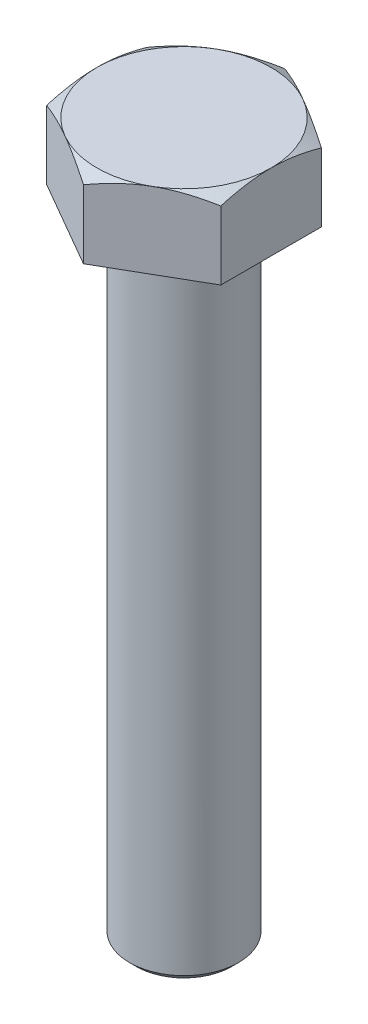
ISO-10303-21;
HEADER;
FILE_DESCRIPTION(('STEP AP214'),'2;1');
FILE_NAME('part.step','',(''),(''),'','','');
FILE_SCHEMA(('AUTOMOTIVE_DESIGN { 1 0 10303 214 1 1 1 1 }'));
ENDSEC;
DATA;
#1=APPLICATION_CONTEXT('core data for automotive mechanical design processes');
#2=APPLICATION_PROTOCOL_DEFINITION('international standard','automotive_design',2000,#1);
#3=PRODUCT_CONTEXT('',#1,'mechanical');
#4=PRODUCT('Part','Part','',(#3));
#5=PRODUCT_RELATED_PRODUCT_CATEGORY('part','',(#4));
#6=PRODUCT_DEFINITION_FORMATION('','',#4);
#7=PRODUCT_DEFINITION_CONTEXT('part definition',#1,'design');
#8=PRODUCT_DEFINITION('design','',#6,#7);
#9=PRODUCT_DEFINITION_SHAPE('','',#8);
#10=(LENGTH_UNIT() NAMED_UNIT(*) SI_UNIT(.MILLI.,.METRE.));
#11=(NAMED_UNIT(*) PLANE_ANGLE_UNIT() SI_UNIT($,.RADIAN.));
#12=(NAMED_UNIT(*) SI_UNIT($,.STERADIAN.) SOLID_ANGLE_UNIT());
#13=UNCERTAINTY_MEASURE_WITH_UNIT(LENGTH_MEASURE(1.E-05),#10,'distance_accuracy_value','');
#14=(GEOMETRIC_REPRESENTATION_CONTEXT(3) GLOBAL_UNCERTAINTY_ASSIGNED_CONTEXT((#13)) GLOBAL_UNIT_ASSIGNED_CONTEXT((#10,
#11,#12)) REPRESENTATION_CONTEXT('',''));
#15=CARTESIAN_POINT('',(0.,0.,0.));
#16=DIRECTION('',(0.,0.,1.));
#17=DIRECTION('',(1.,0.,0.));
#18=AXIS2_PLACEMENT_3D('',#15,#16,#17);
#19=CARTESIAN_POINT('',(0.,-70.,0.));
#20=DIRECTION('',(0.,1.,0.));
#21=DIRECTION('',(0.,0.,1.));
#22=AXIS2_PLACEMENT_3D('',#19,#20,#21);
#23=CYLINDRICAL_SURFACE('',#22,6.);
#24=CARTESIAN_POINT('',(0.,0.,0.));
#25=DIRECTION('',(0.,1.,0.));
#26=DIRECTION('',(0.,0.,1.));
#27=AXIS2_PLACEMENT_3D('',#24,#25,#26);
#28=CIRCLE('',#27,6.);
#29=CARTESIAN_POINT('',(0.,0.,6.));
#30=VERTEX_POINT('',#29);
#31=EDGE_CURVE('E276',#30,#30,#28,.F.);
#32=ORIENTED_EDGE('',*,*,#31,.T.);
#33=EDGE_LOOP('',(#32));
#34=FACE_BOUND('',#33,.T.);
#35=CARTESIAN_POINT('',(0.,-69.25,0.));
#36=DIRECTION('',(0.,1.,0.));
#37=DIRECTION('',(0.,0.,1.));
#38=AXIS2_PLACEMENT_3D('',#35,#36,#37);
#39=CIRCLE('',#38,6.);
#40=CARTESIAN_POINT('',(0.,-69.25,6.));
#41=VERTEX_POINT('',#40);
#42=EDGE_CURVE('E352',#41,#41,#39,.F.);
#43=ORIENTED_EDGE('',*,*,#42,.F.);
#44=EDGE_LOOP('',(#43));
#45=FACE_BOUND('',#44,.T.);
#46=ADVANCED_FACE('F62',(#34,#45),#23,.T.);
#47=CARTESIAN_POINT('',(9.59999999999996,8.4,-5.54256258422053));
#48=DIRECTION('',(-0.499999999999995,0.,0.866025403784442));
#49=DIRECTION('',(0.866025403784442,0.,0.499999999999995));
#50=AXIS2_PLACEMENT_3D('',#47,#48,#49);
#51=PLANE('',#50);
#52=CARTESIAN_POINT('',(9.60019999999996,7.5424959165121,-5.5424471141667));
#53=CARTESIAN_POINT('',(9.3891710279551,7.61282751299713,-5.66428474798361));
#54=CARTESIAN_POINT('',(9.1773552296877,7.67996698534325,-5.7865766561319));
#55=CARTESIAN_POINT('',(8.75202502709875,7.80697596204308,-6.03214116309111));
#56=CARTESIAN_POINT('',(8.53851008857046,7.86684307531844,-6.15541407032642));
#57=CARTESIAN_POINT('',(7.89452489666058,8.03437730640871,-6.52721909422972));
#58=CARTESIAN_POINT('',(7.46151242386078,8.12967000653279,-6.77721896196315));
#59=CARTESIAN_POINT('',(6.8135290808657,8.24140960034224,-7.15133231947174));
#60=CARTESIAN_POINT('',(6.60049410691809,8.27324001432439,-7.2743281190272));
#61=CARTESIAN_POINT('',(6.17343781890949,8.32661759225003,-7.52088918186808));
#62=CARTESIAN_POINT('',(5.95941648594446,8.3481645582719,-7.64445445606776));
#63=CARTESIAN_POINT('',(5.53101681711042,8.38042315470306,-7.89179112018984));
#64=CARTESIAN_POINT('',(5.31663921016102,8.39114766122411,-8.0155620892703));
#65=CARTESIAN_POINT('',(4.88768597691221,8.40153345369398,-8.26321835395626));
#66=CARTESIAN_POINT('',(4.67311035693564,8.40119508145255,-8.38710364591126));
#67=CARTESIAN_POINT('',(4.27195608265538,8.39022474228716,-8.61871017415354));
#68=CARTESIAN_POINT('',(4.08534911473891,8.38093102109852,-8.72644775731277));
#69=CARTESIAN_POINT('',(3.71257161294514,8.35415698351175,-8.94167094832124));
#70=CARTESIAN_POINT('',(3.52640111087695,8.33667608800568,-9.04915653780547));
#71=CARTESIAN_POINT('',(2.96861097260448,8.27236593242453,-9.3711968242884));
#72=CARTESIAN_POINT('',(2.59797866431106,8.21367721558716,-9.58518148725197));
#73=CARTESIAN_POINT('',(1.85278253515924,8.06695487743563,-10.0154206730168));
#74=CARTESIAN_POINT('',(1.47831381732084,7.97829932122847,-10.2316202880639));
#75=CARTESIAN_POINT('',(0.734960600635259,7.77708802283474,-10.6607954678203));
#76=CARTESIAN_POINT('',(0.366066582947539,7.66457953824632,-10.8737765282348));
#77=CARTESIAN_POINT('',(-0.000199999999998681,7.54249591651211,-11.0852406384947));
#78=B_SPLINE_CURVE_WITH_KNOTS('',3,(#52,#53,#54,#55,#56,#57,#58,#59,#60,#61,#62,#63,#64,#65,#66,
#67,#68,#69,#70,#71,#72,#73,#74,#75,#76,#77),.UNSPECIFIED.,.F.,.F.,(4,2,2,2,2,2,2,2,2,2,2,2,4),
(0.,0.760805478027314,1.52186042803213,3.04721013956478,3.79116425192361,4.53513268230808,
5.27821492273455,6.02127420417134,6.66813947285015,7.31505050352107,8.60979186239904,
9.93324753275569,11.2541052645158),.UNSPECIFIED.);
#79=CARTESIAN_POINT('',(9.59999999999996,7.54256258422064,-5.54256258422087));
#80=VERTEX_POINT('',#79);
#81=CARTESIAN_POINT('',(4.79999999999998,8.4,-8.31384387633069));
#82=VERTEX_POINT('',#81);
#83=EDGE_CURVE('E133',#80,#82,#78,.T.);
#84=ORIENTED_EDGE('',*,*,#83,.F.);
#85=DIRECTION('',(0.,-1.,0.));
#86=VECTOR('',#85,1.);
#87=CARTESIAN_POINT('',(9.59999999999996,8.4,-5.54256258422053));
#88=LINE('',#87,#86);
#89=CARTESIAN_POINT('',(9.59999999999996,0.,-5.54256258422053));
#90=VERTEX_POINT('',#89);
#91=EDGE_CURVE('E271',#80,#90,#88,.T.);
#92=ORIENTED_EDGE('',*,*,#91,.T.);
#93=DIRECTION('',(-0.866025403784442,0.,-0.499999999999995));
#94=VECTOR('',#93,1.);
#95=CARTESIAN_POINT('',(9.59999999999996,0.,-5.54256258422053));
#96=LINE('',#95,#94);
#97=CARTESIAN_POINT('',(0.,0.,-11.0851251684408));
#98=VERTEX_POINT('',#97);
#99=EDGE_CURVE('E141',#90,#98,#96,.T.);
#100=ORIENTED_EDGE('',*,*,#99,.T.);
#101=DIRECTION('',(0.,-1.,0.));
#102=VECTOR('',#101,1.);
#103=CARTESIAN_POINT('',(0.,8.4,-11.0851251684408));
#104=LINE('',#103,#102);
#105=CARTESIAN_POINT('',(0.,7.54256258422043,-11.0851251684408));
#106=VERTEX_POINT('',#105);
#107=EDGE_CURVE('E156',#106,#98,#104,.T.);
#108=ORIENTED_EDGE('',*,*,#107,.F.);
#109=EDGE_CURVE('E142',#82,#106,#78,.T.);
#110=ORIENTED_EDGE('',*,*,#109,.F.);
#111=EDGE_LOOP('',(#84,#92,#100,#108,#110));
#112=FACE_BOUND('',#111,.T.);
#113=ADVANCED_FACE('F64',(#112),#51,.F.);
#114=CARTESIAN_POINT('',(0.,8.4,-11.0851251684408));
#115=DIRECTION('',(0.500000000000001,0.,0.866025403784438));
#116=DIRECTION('',(0.866025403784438,0.,-0.500000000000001));
#117=AXIS2_PLACEMENT_3D('',#114,#115,#116);
#118=PLANE('',#117);
#119=CARTESIAN_POINT('',(0.000200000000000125,7.5424959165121,-11.0852406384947));
#120=CARTESIAN_POINT('',(-0.210828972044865,7.61282751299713,-10.9634030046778));
#121=CARTESIAN_POINT('',(-0.422644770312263,7.67996698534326,-10.8411110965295));
#122=CARTESIAN_POINT('',(-0.84797497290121,7.80697596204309,-10.5955465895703));
#123=CARTESIAN_POINT('',(-1.0614899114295,7.86684307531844,-10.472273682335));
#124=CARTESIAN_POINT('',(-1.70547510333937,8.03437730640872,-10.1004686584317));
#125=CARTESIAN_POINT('',(-2.13848757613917,8.12967000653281,-9.85046879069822));
#126=CARTESIAN_POINT('',(-2.78647091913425,8.24140960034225,-9.47635543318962));
#127=CARTESIAN_POINT('',(-2.99950589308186,8.2732400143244,-9.35335963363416));
#128=CARTESIAN_POINT('',(-3.42656218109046,8.32661759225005,-9.10679857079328));
#129=CARTESIAN_POINT('',(-3.64058351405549,8.34816455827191,-8.98323329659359));
#130=CARTESIAN_POINT('',(-4.06898318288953,8.38042315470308,-8.73589663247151));
#131=CARTESIAN_POINT('',(-4.28336078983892,8.39114766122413,-8.61212566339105));
#132=CARTESIAN_POINT('',(-4.71231402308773,8.401533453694,-8.36446939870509));
#133=CARTESIAN_POINT('',(-4.9268896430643,8.40119508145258,-8.24058410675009));
#134=CARTESIAN_POINT('',(-5.32804391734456,8.39022474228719,-8.00897757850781));
#135=CARTESIAN_POINT('',(-5.51465088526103,8.38093102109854,-7.90123999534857));
#136=CARTESIAN_POINT('',(-5.88742838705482,8.35415698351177,-7.68601680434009));
#137=CARTESIAN_POINT('',(-6.07359888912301,8.33667608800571,-7.57853121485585));
#138=CARTESIAN_POINT('',(-6.63138902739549,8.27236593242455,-7.25649092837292));
#139=CARTESIAN_POINT('',(-7.00202133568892,8.21367721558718,-7.04250626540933));
#140=CARTESIAN_POINT('',(-7.74721746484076,8.06695487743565,-6.61226707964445));
#141=CARTESIAN_POINT('',(-8.12168618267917,7.97829932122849,-6.39606746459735));
#142=CARTESIAN_POINT('',(-8.86503939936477,7.77708802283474,-5.96689228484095));
#143=CARTESIAN_POINT('',(-9.2339334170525,7.66457953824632,-5.75391122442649));
#144=CARTESIAN_POINT('',(-9.60020000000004,7.5424959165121,-5.54244711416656));
#145=B_SPLINE_CURVE_WITH_KNOTS('',3,(#119,#120,#121,#122,#123,#124,#125,#126,#127,#128,#129,
#130,#131,#132,#133,#134,#135,#136,#137,#138,#139,#140,#141,#142,#143,#144),.UNSPECIFIED.,.F.,
.F.,(4,2,2,2,2,2,2,2,2,2,2,2,4),(0.,0.760805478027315,1.52186042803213,3.04721013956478,
3.79116425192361,4.53513268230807,5.27821492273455,6.02127420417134,6.66813947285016,
7.3150505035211,8.60979186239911,9.9332475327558,11.2541052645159),.UNSPECIFIED.);
#146=CARTESIAN_POINT('',(-4.80000000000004,8.4,-8.31384387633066));
#147=VERTEX_POINT('',#146);
#148=EDGE_CURVE('E148',#106,#147,#145,.T.);
#149=ORIENTED_EDGE('',*,*,#148,.F.);
#150=ORIENTED_EDGE('',*,*,#107,.T.);
#151=DIRECTION('',(-0.866025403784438,0.,0.500000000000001));
#152=VECTOR('',#151,1.);
#153=CARTESIAN_POINT('',(0.,0.,-11.0851251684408));
#154=LINE('',#153,#152);
#155=CARTESIAN_POINT('',(-9.60000000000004,0.,-5.5425625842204));
#156=VERTEX_POINT('',#155);
#157=EDGE_CURVE('E311',#98,#156,#154,.T.);
#158=ORIENTED_EDGE('',*,*,#157,.T.);
#159=DIRECTION('',(0.,-1.,0.));
#160=VECTOR('',#159,1.);
#161=CARTESIAN_POINT('',(-9.60000000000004,8.4,-5.5425625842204));
#162=LINE('',#161,#160);
#163=CARTESIAN_POINT('',(-9.60000000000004,7.54256258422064,-5.54256258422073));
#164=VERTEX_POINT('',#163);
#165=EDGE_CURVE('E269',#164,#156,#162,.T.);
#166=ORIENTED_EDGE('',*,*,#165,.F.);
#167=EDGE_CURVE('E157',#147,#164,#145,.T.);
#168=ORIENTED_EDGE('',*,*,#167,.F.);
#169=EDGE_LOOP('',(#149,#150,#158,#166,#168));
#170=FACE_BOUND('',#169,.T.);
#171=ADVANCED_FACE('F217',(#170),#118,.F.);
#172=CARTESIAN_POINT('',(-9.60000000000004,8.4,-5.5425625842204));
#173=DIRECTION('',(1.,0.,0.));
#174=DIRECTION('',(0.,0.,-1.));
#175=AXIS2_PLACEMENT_3D('',#172,#173,#174);
#176=PLANE('',#175);
#177=CARTESIAN_POINT('',(-9.60000000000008,3.57852177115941,-15.1683890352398));
#178=CARTESIAN_POINT('',(-9.60000000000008,3.68139894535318,-14.9575076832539));
#179=CARTESIAN_POINT('',(-9.60000000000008,3.78378385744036,-14.7463862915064));
#180=CARTESIAN_POINT('',(-9.60000000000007,3.98745817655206,-14.32361343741));
#181=CARTESIAN_POINT('',(-9.60000000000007,4.08874757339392,-14.1119619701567));
#182=CARTESIAN_POINT('',(-9.60000000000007,4.39083098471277,-13.476084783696));
#183=CARTESIAN_POINT('',(-9.60000000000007,4.58981172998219,-13.0509945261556));
#184=CARTESIAN_POINT('',(-9.60000000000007,4.98279823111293,-12.1958793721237));
#185=CARTESIAN_POINT('',(-9.60000000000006,5.17677333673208,-11.7658403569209));
#186=CARTESIAN_POINT('',(-9.60000000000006,5.5571528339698,-10.9024388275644));
#187=CARTESIAN_POINT('',(-9.60000000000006,5.74355756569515,-10.4690764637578));
#188=CARTESIAN_POINT('',(-9.60000000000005,6.11302652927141,-9.58341710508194));
#189=CARTESIAN_POINT('',(-9.60000000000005,6.29575725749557,-9.13098024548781));
#190=CARTESIAN_POINT('',(-9.60000000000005,6.64805588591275,-8.22091922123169));
#191=CARTESIAN_POINT('',(-9.60000000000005,6.81762234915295,-7.76329449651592));
#192=CARTESIAN_POINT('',(-9.60000000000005,7.13934525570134,-6.84289322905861));
#193=CARTESIAN_POINT('',(-9.60000000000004,7.29153462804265,-6.38012831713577));
#194=CARTESIAN_POINT('',(-9.60000000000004,7.5738080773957,-5.44798252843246));
#195=CARTESIAN_POINT('',(-9.60000000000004,7.70389882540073,-4.97860369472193));
#196=CARTESIAN_POINT('',(-9.60000000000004,7.93522050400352,-4.03549571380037));
#197=CARTESIAN_POINT('',(-9.60000000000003,8.03661483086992,-3.5618077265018));
#198=CARTESIAN_POINT('',(-9.60000000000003,8.16293177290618,-2.84674715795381));
#199=CARTESIAN_POINT('',(-9.60000000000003,8.20074323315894,-2.60762365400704));
#200=CARTESIAN_POINT('',(-9.60000000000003,8.26704083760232,-2.128095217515));
#201=CARTESIAN_POINT('',(-9.60000000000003,8.29552788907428,-1.88769041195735));
#202=CARTESIAN_POINT('',(-9.60000000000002,8.34223654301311,-1.40918403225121));
#203=CARTESIAN_POINT('',(-9.60000000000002,8.36059257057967,-1.17109563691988));
#204=CARTESIAN_POINT('',(-9.60000000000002,8.38720937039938,-0.694354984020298));
#205=CARTESIAN_POINT('',(-9.60000000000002,8.39547031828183,-0.455702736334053));
#206=CARTESIAN_POINT('',(-9.60000000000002,8.40169855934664,0.0217394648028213));
#207=CARTESIAN_POINT('',(-9.60000000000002,8.39966580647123,0.260529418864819));
#208=CARTESIAN_POINT('',(-9.60000000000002,8.38535918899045,0.737804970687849));
#209=CARTESIAN_POINT('',(-9.60000000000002,8.37308486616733,0.976290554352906));
#210=CARTESIAN_POINT('',(-9.60000000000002,8.33215536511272,1.54107551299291));
#211=CARTESIAN_POINT('',(-9.60000000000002,8.29910710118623,1.8670640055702));
#212=CARTESIAN_POINT('',(-9.60000000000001,8.21561562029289,2.5167876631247));
#213=CARTESIAN_POINT('',(-9.60000000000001,8.16517027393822,2.84052254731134));
#214=CARTESIAN_POINT('',(-9.60000000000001,7.99040011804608,3.80787417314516));
#215=CARTESIAN_POINT('',(-9.6,7.8426668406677,4.44732708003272));
#216=CARTESIAN_POINT('',(-9.6,7.58431933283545,5.40406420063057));
#217=CARTESIAN_POINT('',(-9.6,7.49078600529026,5.72624762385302));
#218=CARTESIAN_POINT('',(-9.6,7.29346757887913,6.36749078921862));
#219=CARTESIAN_POINT('',(-9.6,7.18968239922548,6.68655050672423));
#220=CARTESIAN_POINT('',(-9.59999999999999,6.97356961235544,7.32164026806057));
#221=CARTESIAN_POINT('',(-9.59999999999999,6.8612443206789,7.63767110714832));
#222=CARTESIAN_POINT('',(-9.59999999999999,6.6294263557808,8.26707536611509));
#223=CARTESIAN_POINT('',(-9.59999999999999,6.50993385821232,8.58044885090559));
#224=CARTESIAN_POINT('',(-9.59999999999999,6.17417376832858,9.43626632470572));
#225=CARTESIAN_POINT('',(-9.59999999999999,5.95182759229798,9.97632346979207));
#226=CARTESIAN_POINT('',(-9.59999999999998,5.49373499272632,11.0507460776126));
#227=CARTESIAN_POINT('',(-9.59999999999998,5.25798697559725,11.5851108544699));
#228=CARTESIAN_POINT('',(-9.59999999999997,4.77631628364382,12.649482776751));
#229=CARTESIAN_POINT('',(-9.59999999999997,4.53038948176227,13.1794880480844));
#230=CARTESIAN_POINT('',(-9.59999999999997,4.03083881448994,14.2358173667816));
#231=CARTESIAN_POINT('',(-9.59999999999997,3.77721528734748,14.7621415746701));
#232=CARTESIAN_POINT('',(-9.59999999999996,3.26354094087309,15.8127361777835));
#233=CARTESIAN_POINT('',(-9.59999999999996,3.0034800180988,16.3370016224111));
#234=CARTESIAN_POINT('',(-9.59999999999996,2.47860518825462,17.3831496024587));
#235=CARTESIAN_POINT('',(-9.59999999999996,2.2137912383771,17.905032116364));
#236=CARTESIAN_POINT('',(-9.59999999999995,1.68042002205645,18.9467229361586));
#237=CARTESIAN_POINT('',(-9.59999999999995,1.41186365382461,19.4665317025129));
#238=CARTESIAN_POINT('',(-9.59999999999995,0.871656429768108,20.5045396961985));
#239=CARTESIAN_POINT('',(-9.59999999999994,0.60000556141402,21.0227389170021));
#240=CARTESIAN_POINT('',(-9.59999999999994,-0.159476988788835,22.4629524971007));
#241=CARTESIAN_POINT('',(-9.59999999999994,-0.650063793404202,23.383513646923));
#242=CARTESIAN_POINT('',(-9.59999999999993,-1.63706570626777,25.2215771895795));
#243=CARTESIAN_POINT('',(-9.59999999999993,-2.13348119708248,26.1390793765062));
#244=CARTESIAN_POINT('',(-9.59999999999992,-3.12890900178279,27.9685293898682));
#245=CARTESIAN_POINT('',(-9.59999999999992,-3.62790623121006,28.880485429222));
#246=CARTESIAN_POINT('',(-9.59999999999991,-4.37885403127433,30.2470215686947));
#247=CARTESIAN_POINT('',(-9.59999999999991,-4.62956827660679,30.7022819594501));
#248=CARTESIAN_POINT('',(-9.59999999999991,-5.13172891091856,31.6123980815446));
#249=CARTESIAN_POINT('',(-9.59999999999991,-5.38317529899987,32.0672538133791));
#250=CARTESIAN_POINT('',(-9.5999999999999,-5.63494211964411,32.5219321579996));
#251=B_SPLINE_CURVE_WITH_KNOTS('',3,(#177,#178,#179,#180,#181,#182,#183,#184,#185,#186,#187,
#188,#189,#190,#191,#192,#193,#194,#195,#196,#197,#198,#199,#200,#201,#202,#203,#204,#205,#206,
#207,#208,#209,#210,#211,#212,#213,#214,#215,#216,#217,#218,#219,#220,#221,#222,#223,#224,#225,
#226,#227,#228,#229,#230,#231,#232,#233,#234,#235,#236,#237,#238,#239,#240,#241,#242,#243,#244,
#245,#246,#247,#248,#249,#250),.UNSPECIFIED.,.F.,.F.,(4,2,2,2,2,2,2,2,2,2,2,2,2,2,2,2,2,2,2,2,2,
2,2,2,2,2,2,2,2,2,2,2,2,2,2,2,4),(0.,0.703910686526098,1.40782791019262,2.81585686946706,
4.23108733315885,5.64625414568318,7.10992793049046,8.57376125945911,10.0347729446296,
11.495342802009,12.9474207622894,13.6735512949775,14.3996111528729,15.1157901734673,
15.8319567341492,16.5481264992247,17.2643283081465,18.2467574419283,19.2293068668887,
21.1953370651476,22.2017021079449,23.2080750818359,24.2141761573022,25.2202525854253,
26.9720908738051,28.7241379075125,30.4769024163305,32.2295900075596,33.9852288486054,
35.7408835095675,37.4961238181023,39.2513712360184,42.3807113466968,45.5102580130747,
48.6288953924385,50.1880860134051,51.7472747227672),.UNSPECIFIED.);
#252=CARTESIAN_POINT('',(-9.60000000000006,8.4,0.));
#253=VERTEX_POINT('',#252);
#254=EDGE_CURVE('E211',#164,#253,#251,.T.);
#255=ORIENTED_EDGE('',*,*,#254,.F.);
#256=ORIENTED_EDGE('',*,*,#165,.T.);
#257=DIRECTION('',(0.,0.,1.));
#258=VECTOR('',#257,1.);
#259=CARTESIAN_POINT('',(-9.60000000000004,0.,-5.5425625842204));
#260=LINE('',#259,#258);
#261=CARTESIAN_POINT('',(-9.6,0.,5.54256258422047));
#262=VERTEX_POINT('',#261);
#263=EDGE_CURVE('E310',#156,#262,#260,.T.);
#264=ORIENTED_EDGE('',*,*,#263,.T.);
#265=DIRECTION('',(0.,-1.,0.));
#266=VECTOR('',#265,1.);
#267=CARTESIAN_POINT('',(-9.6,8.4,5.54256258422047));
#268=LINE('',#267,#266);
#269=CARTESIAN_POINT('',(-9.6,7.54256258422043,5.54256258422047));
#270=VERTEX_POINT('',#269);
#271=EDGE_CURVE('E266',#270,#262,#268,.T.);
#272=ORIENTED_EDGE('',*,*,#271,.F.);
#273=EDGE_CURVE('E205',#253,#270,#251,.T.);
#274=ORIENTED_EDGE('',*,*,#273,.F.);
#275=EDGE_LOOP('',(#255,#256,#264,#272,#274));
#276=FACE_BOUND('',#275,.T.);
#277=ADVANCED_FACE('F213',(#276),#176,.F.);
#278=CARTESIAN_POINT('',(-9.6,8.4,5.54256258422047));
#279=DIRECTION('',(0.499999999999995,0.,-0.866025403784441));
#280=DIRECTION('',(-0.866025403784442,0.,-0.499999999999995));
#281=AXIS2_PLACEMENT_3D('',#278,#279,#280);
#282=PLANE('',#281);
#283=CARTESIAN_POINT('',(-9.6002,7.5424959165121,5.54244711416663));
#284=CARTESIAN_POINT('',(-9.38917102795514,7.61282751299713,5.66428474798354));
#285=CARTESIAN_POINT('',(-9.17735522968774,7.67996698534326,5.78657665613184));
#286=CARTESIAN_POINT('',(-8.75202502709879,7.80697596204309,6.03214116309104));
#287=CARTESIAN_POINT('',(-8.5385100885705,7.86684307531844,6.15541407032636));
#288=CARTESIAN_POINT('',(-7.89452489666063,8.03437730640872,6.52721909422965));
#289=CARTESIAN_POINT('',(-7.46151242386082,8.1296700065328,6.77721896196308));
#290=CARTESIAN_POINT('',(-6.81352908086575,8.24140960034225,7.15133231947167));
#291=CARTESIAN_POINT('',(-6.60049410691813,8.2732400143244,7.27432811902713));
#292=CARTESIAN_POINT('',(-6.17343781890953,8.32661759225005,7.52088918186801));
#293=CARTESIAN_POINT('',(-5.9594164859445,8.34816455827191,7.6444544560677));
#294=CARTESIAN_POINT('',(-5.53101681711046,8.38042315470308,7.89179112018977));
#295=CARTESIAN_POINT('',(-5.31663921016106,8.39114766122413,8.01556208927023));
#296=CARTESIAN_POINT('',(-4.88768597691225,8.401533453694,8.26321835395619));
#297=CARTESIAN_POINT('',(-4.67311035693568,8.40119508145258,8.38710364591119));
#298=CARTESIAN_POINT('',(-4.27195608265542,8.39022474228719,8.61871017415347));
#299=CARTESIAN_POINT('',(-4.08534911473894,8.38093102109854,8.7264477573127));
#300=CARTESIAN_POINT('',(-3.71257161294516,8.35415698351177,8.94167094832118));
#301=CARTESIAN_POINT('',(-3.52640111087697,8.33667608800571,9.04915653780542));
#302=CARTESIAN_POINT('',(-2.96861097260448,8.27236593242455,9.37119682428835));
#303=CARTESIAN_POINT('',(-2.59797866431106,8.21367721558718,9.58518148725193));
#304=CARTESIAN_POINT('',(-1.85278253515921,8.06695487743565,10.0154206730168));
#305=CARTESIAN_POINT('',(-1.4783138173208,7.97829932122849,10.2316202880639));
#306=CARTESIAN_POINT('',(-0.734960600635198,7.77708802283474,10.6607954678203));
#307=CARTESIAN_POINT('',(-0.366066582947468,7.66457953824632,10.8737765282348));
#308=CARTESIAN_POINT('',(0.00020000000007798,7.5424959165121,11.0852406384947));
#309=B_SPLINE_CURVE_WITH_KNOTS('',3,(#283,#284,#285,#286,#287,#288,#289,#290,#291,#292,#293,
#294,#295,#296,#297,#298,#299,#300,#301,#302,#303,#304,#305,#306,#307,#308),.UNSPECIFIED.,.F.,
.F.,(4,2,2,2,2,2,2,2,2,2,2,2,4),(0.,0.760805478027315,1.52186042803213,3.04721013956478,
3.79116425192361,4.53513268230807,5.27821492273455,6.02127420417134,6.66813947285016,
7.3150505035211,8.6097918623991,9.93324753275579,11.2541052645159),.UNSPECIFIED.);
#310=CARTESIAN_POINT('',(-4.79999999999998,8.4,8.31384387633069));
#311=VERTEX_POINT('',#310);
#312=EDGE_CURVE('E212',#270,#311,#309,.T.);
#313=ORIENTED_EDGE('',*,*,#312,.F.);
#314=ORIENTED_EDGE('',*,*,#271,.T.);
#315=DIRECTION('',(0.866025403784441,0.,0.499999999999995));
#316=VECTOR('',#315,1.);
#317=CARTESIAN_POINT('',(-9.6,0.,5.54256258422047));
#318=LINE('',#317,#316);
#319=CARTESIAN_POINT('',(0.,0.,11.0851251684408));
#320=VERTEX_POINT('',#319);
#321=EDGE_CURVE('E264',#262,#320,#318,.T.);
#322=ORIENTED_EDGE('',*,*,#321,.T.);
#323=DIRECTION('',(0.,-1.,0.));
#324=VECTOR('',#323,1.);
#325=CARTESIAN_POINT('',(0.,8.4,11.0851251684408));
#326=LINE('',#325,#324);
#327=CARTESIAN_POINT('',(0.,7.54256258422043,11.0851251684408));
#328=VERTEX_POINT('',#327);
#329=EDGE_CURVE('E256',#328,#320,#326,.T.);
#330=ORIENTED_EDGE('',*,*,#329,.F.);
#331=EDGE_CURVE('E199',#311,#328,#309,.T.);
#332=ORIENTED_EDGE('',*,*,#331,.F.);
#333=EDGE_LOOP('',(#313,#314,#322,#330,#332));
#334=FACE_BOUND('',#333,.T.);
#335=ADVANCED_FACE('F216',(#334),#282,.F.);
#336=CARTESIAN_POINT('',(0.,8.4,11.0851251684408));
#337=DIRECTION('',(-0.500000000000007,0.,-0.866025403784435));
#338=DIRECTION('',(-0.866025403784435,0.,0.500000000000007));
#339=AXIS2_PLACEMENT_3D('',#336,#337,#338);
#340=PLANE('',#339);
#341=CARTESIAN_POINT('',(-0.00019999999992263,7.5424959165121,11.0852406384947));
#342=CARTESIAN_POINT('',(0.210828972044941,7.61282751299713,10.9634030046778));
#343=CARTESIAN_POINT('',(0.422644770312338,7.67996698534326,10.8411110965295));
#344=CARTESIAN_POINT('',(0.847974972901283,7.80697596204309,10.5955465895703));
#345=CARTESIAN_POINT('',(1.06148991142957,7.86684307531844,10.4722736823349));
#346=CARTESIAN_POINT('',(1.70547510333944,8.03437730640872,10.1004686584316));
#347=CARTESIAN_POINT('',(2.13848757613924,8.1296700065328,9.85046879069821));
#348=CARTESIAN_POINT('',(2.78647091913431,8.24140960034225,9.4763554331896));
#349=CARTESIAN_POINT('',(2.99950589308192,8.2732400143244,9.35335963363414));
#350=CARTESIAN_POINT('',(3.42656218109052,8.32661759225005,9.10679857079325));
#351=CARTESIAN_POINT('',(3.64058351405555,8.34816455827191,8.98323329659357));
#352=CARTESIAN_POINT('',(4.06898318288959,8.38042315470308,8.73589663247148));
#353=CARTESIAN_POINT('',(4.28336078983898,8.39114766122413,8.61212566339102));
#354=CARTESIAN_POINT('',(4.71231402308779,8.401533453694,8.36446939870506));
#355=CARTESIAN_POINT('',(4.92688964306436,8.40119508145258,8.24058410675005));
#356=CARTESIAN_POINT('',(5.32804391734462,8.39022474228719,8.00897757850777));
#357=CARTESIAN_POINT('',(5.51465088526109,8.38093102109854,7.90123999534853));
#358=CARTESIAN_POINT('',(5.88742838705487,8.35415698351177,7.68601680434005));
#359=CARTESIAN_POINT('',(6.07359888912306,8.33667608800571,7.57853121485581));
#360=CARTESIAN_POINT('',(6.63138902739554,8.27236593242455,7.25649092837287));
#361=CARTESIAN_POINT('',(7.00202133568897,8.21367721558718,7.04250626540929));
#362=CARTESIAN_POINT('',(7.7472174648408,8.06695487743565,6.6122670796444));
#363=CARTESIAN_POINT('',(8.12168618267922,7.97829932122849,6.39606746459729));
#364=CARTESIAN_POINT('',(8.86503939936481,7.77708802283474,5.96689228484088));
#365=CARTESIAN_POINT('',(9.23393341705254,7.66457953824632,5.75391122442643));
#366=CARTESIAN_POINT('',(9.60020000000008,7.5424959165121,5.5424471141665));
#367=B_SPLINE_CURVE_WITH_KNOTS('',3,(#341,#342,#343,#344,#345,#346,#347,#348,#349,#350,#351,
#352,#353,#354,#355,#356,#357,#358,#359,#360,#361,#362,#363,#364,#365,#366),.UNSPECIFIED.,.F.,
.F.,(4,2,2,2,2,2,2,2,2,2,2,2,4),(0.,0.760805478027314,1.52186042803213,3.04721013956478,
3.79116425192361,4.53513268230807,5.27821492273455,6.02127420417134,6.66813947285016,
7.3150505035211,8.6097918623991,9.9332475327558,11.2541052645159),.UNSPECIFIED.);
#368=CARTESIAN_POINT('',(4.8000000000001,8.4,8.31384387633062));
#369=VERTEX_POINT('',#368);
#370=EDGE_CURVE('E253',#328,#369,#367,.T.);
#371=ORIENTED_EDGE('',*,*,#370,.F.);
#372=ORIENTED_EDGE('',*,*,#329,.T.);
#373=DIRECTION('',(0.866025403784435,0.,-0.500000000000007));
#374=VECTOR('',#373,1.);
#375=CARTESIAN_POINT('',(0.,0.,11.0851251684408));
#376=LINE('',#375,#374);
#377=CARTESIAN_POINT('',(9.60000000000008,0.,5.54256258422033));
#378=VERTEX_POINT('',#377);
#379=EDGE_CURVE('E300',#320,#378,#376,.T.);
#380=ORIENTED_EDGE('',*,*,#379,.T.);
#381=DIRECTION('',(0.,-1.,0.));
#382=VECTOR('',#381,1.);
#383=CARTESIAN_POINT('',(9.60000000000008,8.4,5.54256258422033));
#384=LINE('',#383,#382);
#385=CARTESIAN_POINT('',(9.60000000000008,7.54256258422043,5.54256258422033));
#386=VERTEX_POINT('',#385);
#387=EDGE_CURVE('E267',#386,#378,#384,.T.);
#388=ORIENTED_EDGE('',*,*,#387,.F.);
#389=EDGE_CURVE('E192',#369,#386,#367,.T.);
#390=ORIENTED_EDGE('',*,*,#389,.F.);
#391=EDGE_LOOP('',(#371,#372,#380,#388,#390));
#392=FACE_BOUND('',#391,.T.);
#393=ADVANCED_FACE('F242',(#392),#340,.F.);
#394=CARTESIAN_POINT('',(9.60000000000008,8.4,5.54256258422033));
#395=DIRECTION('',(-1.,0.,0.));
#396=DIRECTION('',(0.,0.,1.));
#397=AXIS2_PLACEMENT_3D('',#394,#395,#396);
#398=PLANE('',#397);
#399=CARTESIAN_POINT('',(9.59999999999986,3.57852177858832,-15.1683890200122));
#400=CARTESIAN_POINT('',(9.59999999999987,3.68139895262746,-14.9575076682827));
#401=CARTESIAN_POINT('',(9.59999999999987,3.78378386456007,-14.7463862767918));
#402=CARTESIAN_POINT('',(9.59999999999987,3.98745818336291,-14.3236134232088));
#403=CARTESIAN_POINT('',(9.59999999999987,4.08874758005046,-14.1119619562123));
#404=CARTESIAN_POINT('',(9.59999999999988,4.39083099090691,-13.4760847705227));
#405=CARTESIAN_POINT('',(9.59999999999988,4.58981173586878,-13.0509945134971));
#406=CARTESIAN_POINT('',(9.59999999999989,4.98279823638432,-12.1958793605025));
#407=CARTESIAN_POINT('',(9.5999999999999,5.17677334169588,-11.7658403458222));
#408=CARTESIAN_POINT('',(9.59999999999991,5.55715283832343,-10.9024388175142));
#409=CARTESIAN_POINT('',(9.59999999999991,5.74355756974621,-10.4690764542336));
#410=CARTESIAN_POINT('',(9.59999999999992,6.11302653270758,-9.58341709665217));
#411=CARTESIAN_POINT('',(9.59999999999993,6.29575726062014,-9.13098023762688));
#412=CARTESIAN_POINT('',(9.59999999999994,6.64805588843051,-8.22091921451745));
#413=CARTESIAN_POINT('',(9.59999999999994,6.81762235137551,-7.76329449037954));
#414=CARTESIAN_POINT('',(9.59999999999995,7.13934525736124,-6.84289322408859));
#415=CARTESIAN_POINT('',(9.59999999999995,7.29153462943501,-6.38012831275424));
#416=CARTESIAN_POINT('',(9.59999999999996,7.57380807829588,-5.44798252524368));
#417=CARTESIAN_POINT('',(9.59999999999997,7.70389882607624,-4.97860369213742));
#418=CARTESIAN_POINT('',(9.59999999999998,7.9352205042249,-4.0354957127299));
#419=CARTESIAN_POINT('',(9.59999999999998,8.0366148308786,-3.5618077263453));
#420=CARTESIAN_POINT('',(9.59999999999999,8.16293177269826,-2.8467471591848));
#421=CARTESIAN_POINT('',(9.59999999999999,8.2007432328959,-2.60762365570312));
#422=CARTESIAN_POINT('',(9.6,8.26704083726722,-2.12809522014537));
#423=CARTESIAN_POINT('',(9.6,8.29552788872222,-1.88769041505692));
#424=CARTESIAN_POINT('',(9.60000000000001,8.34223654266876,-1.40918403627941));
#425=CARTESIAN_POINT('',(9.60000000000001,8.36059257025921,-1.17109564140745));
#426=CARTESIAN_POINT('',(9.60000000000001,8.3872093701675,-0.69435498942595));
#427=CARTESIAN_POINT('',(9.60000000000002,8.39547031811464,-0.455702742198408));
#428=CARTESIAN_POINT('',(9.60000000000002,8.40169855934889,0.0217394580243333));
#429=CARTESIAN_POINT('',(9.60000000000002,8.39966580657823,0.260529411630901));
#430=CARTESIAN_POINT('',(9.60000000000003,8.38535918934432,0.737804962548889));
#431=CARTESIAN_POINT('',(9.60000000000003,8.37308486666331,0.976290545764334));
#432=CARTESIAN_POINT('',(9.60000000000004,8.332155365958,1.54107550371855));
#433=CARTESIAN_POINT('',(9.60000000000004,8.29910710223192,1.86706399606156));
#434=CARTESIAN_POINT('',(9.60000000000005,8.21561562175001,2.51678765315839));
#435=CARTESIAN_POINT('',(9.60000000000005,8.16517027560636,2.84052253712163));
#436=CARTESIAN_POINT('',(9.60000000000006,7.99040012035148,3.80787416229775));
#437=CARTESIAN_POINT('',(9.60000000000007,7.84266684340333,4.44732706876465));
#438=CARTESIAN_POINT('',(9.60000000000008,7.5843193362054,5.40406418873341));
#439=CARTESIAN_POINT('',(9.60000000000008,7.4907860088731,5.72624761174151));
#440=CARTESIAN_POINT('',(9.60000000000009,7.29346758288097,6.36749077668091));
#441=CARTESIAN_POINT('',(9.60000000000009,7.18968240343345,6.68655049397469));
#442=CARTESIAN_POINT('',(9.6000000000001,6.97356961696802,7.32164025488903));
#443=CARTESIAN_POINT('',(9.6000000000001,6.86124432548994,7.63767109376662));
#444=CARTESIAN_POINT('',(9.60000000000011,6.62942636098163,8.26707535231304));
#445=CARTESIAN_POINT('',(9.60000000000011,6.50993386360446,8.58044883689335));
#446=CARTESIAN_POINT('',(9.60000000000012,6.17417377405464,9.43626631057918));
#447=CARTESIAN_POINT('',(9.60000000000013,5.95182759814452,9.9763234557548));
#448=CARTESIAN_POINT('',(9.60000000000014,5.49373499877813,11.0507460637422));
#449=CARTESIAN_POINT('',(9.60000000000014,5.25798698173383,11.5851108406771));
#450=CARTESIAN_POINT('',(9.60000000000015,4.77631628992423,12.649482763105));
#451=CARTESIAN_POINT('',(9.60000000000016,4.53038948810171,13.1794880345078));
#452=CARTESIAN_POINT('',(9.60000000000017,4.03083882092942,14.235817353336));
#453=CARTESIAN_POINT('',(9.60000000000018,3.777215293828,14.7621415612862));
#454=CARTESIAN_POINT('',(9.60000000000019,3.26354094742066,15.8127361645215));
#455=CARTESIAN_POINT('',(9.60000000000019,3.00348002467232,16.3370016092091));
#456=CARTESIAN_POINT('',(9.6000000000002,2.47860519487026,17.3831495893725));
#457=CARTESIAN_POINT('',(9.60000000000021,2.21379124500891,17.9050321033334));
#458=CARTESIAN_POINT('',(9.60000000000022,1.6804200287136,18.9467229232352));
#459=CARTESIAN_POINT('',(9.60000000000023,1.41186366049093,19.4665316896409));
#460=CARTESIAN_POINT('',(9.60000000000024,0.871656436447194,20.5045396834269));
#461=CARTESIAN_POINT('',(9.60000000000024,0.600005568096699,21.0227389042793));
#462=CARTESIAN_POINT('',(9.60000000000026,-0.15947698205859,22.4629524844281));
#463=CARTESIAN_POINT('',(9.60000000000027,-0.650063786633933,23.38351363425));
#464=CARTESIAN_POINT('',(9.60000000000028,-1.63706569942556,25.2215771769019));
#465=CARTESIAN_POINT('',(9.60000000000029,-2.13348119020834,26.1390793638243));
#466=CARTESIAN_POINT('',(9.60000000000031,-3.12890899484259,27.9685293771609));
#467=CARTESIAN_POINT('',(9.60000000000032,-3.62790622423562,28.8804854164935));
#468=CARTESIAN_POINT('',(9.60000000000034,-4.37885402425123,30.2470215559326));
#469=CARTESIAN_POINT('',(9.60000000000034,-4.62956826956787,30.7022819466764));
#470=CARTESIAN_POINT('',(9.60000000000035,-5.1317289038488,31.6123980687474));
#471=CARTESIAN_POINT('',(9.60000000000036,-5.38317529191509,32.0672538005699));
#472=CARTESIAN_POINT('',(9.60000000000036,-5.63494211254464,32.5219321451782));
#473=B_SPLINE_CURVE_WITH_KNOTS('',3,(#399,#400,#401,#402,#403,#404,#405,#406,#407,#408,#409,
#410,#411,#412,#413,#414,#415,#416,#417,#418,#419,#420,#421,#422,#423,#424,#425,#426,#427,#428,
#429,#430,#431,#432,#433,#434,#435,#436,#437,#438,#439,#440,#441,#442,#443,#444,#445,#446,#447,
#448,#449,#450,#451,#452,#453,#454,#455,#456,#457,#458,#459,#460,#461,#462,#463,#464,#465,#466,
#467,#468,#469,#470,#471,#472),.UNSPECIFIED.,.F.,.F.,(4,2,2,2,2,2,2,2,2,2,2,2,2,2,2,2,2,2,2,2,2,
2,2,2,2,2,2,2,2,2,2,2,2,2,2,2,4),(0.,0.703910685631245,1.40782790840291,2.8158568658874,
4.23108732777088,5.64625413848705,7.10992792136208,8.57376124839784,10.0347729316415,
11.4953427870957,12.9474207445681,13.6735512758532,14.399611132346,15.1157901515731,
15.8319567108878,16.5481264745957,17.2643282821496,18.246757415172,19.2293068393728,
21.1953370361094,22.2017020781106,23.2080750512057,24.2141761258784,25.2202525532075,
26.9720908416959,28.7241378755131,30.4769023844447,32.229589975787,33.9852288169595,
35.7408834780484,37.4961237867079,39.2513712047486,42.3807113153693,45.5102579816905,
48.628895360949,50.1880859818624,51.7472746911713),.UNSPECIFIED.);
#474=CARTESIAN_POINT('',(9.60000000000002,8.4,0.));
#475=VERTEX_POINT('',#474);
#476=EDGE_CURVE('E298',#386,#475,#473,.F.);
#477=ORIENTED_EDGE('',*,*,#476,.F.);
#478=ORIENTED_EDGE('',*,*,#387,.T.);
#479=DIRECTION('',(0.,0.,-1.));
#480=VECTOR('',#479,1.);
#481=CARTESIAN_POINT('',(9.60000000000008,0.,5.54256258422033));
#482=LINE('',#481,#480);
#483=EDGE_CURVE('E303',#378,#90,#482,.T.);
#484=ORIENTED_EDGE('',*,*,#483,.T.);
#485=ORIENTED_EDGE('',*,*,#91,.F.);
#486=EDGE_CURVE('E137',#475,#80,#473,.F.);
#487=ORIENTED_EDGE('',*,*,#486,.F.);
#488=EDGE_LOOP('',(#477,#478,#484,#485,#487));
#489=FACE_BOUND('',#488,.T.);
#490=ADVANCED_FACE('F238',(#489),#398,.F.);
#491=CARTESIAN_POINT('',(0.,0.,0.));
#492=DIRECTION('',(0.,1.,0.));
#493=DIRECTION('',(0.,0.,1.));
#494=AXIS2_PLACEMENT_3D('',#491,#492,#493);
#495=PLANE('',#494);
#496=ORIENTED_EDGE('',*,*,#31,.F.);
#497=EDGE_LOOP('',(#496));
#498=FACE_BOUND('',#497,.T.);
#499=ORIENTED_EDGE('',*,*,#99,.F.);
#500=ORIENTED_EDGE('',*,*,#483,.F.);
#501=ORIENTED_EDGE('',*,*,#379,.F.);
#502=ORIENTED_EDGE('',*,*,#321,.F.);
#503=ORIENTED_EDGE('',*,*,#263,.F.);
#504=ORIENTED_EDGE('',*,*,#157,.F.);
#505=EDGE_LOOP('',(#499,#500,#501,#502,#503,#504));
#506=FACE_BOUND('',#505,.T.);
#507=ADVANCED_FACE('F235',(#498,#506),#495,.F.);
#508=CARTESIAN_POINT('',(0.,8.4,0.));
#509=DIRECTION('',(0.,-1.,0.));
#510=DIRECTION('',(0.,0.,1.));
#511=AXIS2_PLACEMENT_3D('',#508,#509,#510);
#512=CONICAL_SURFACE('',#511,9.60000000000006,1.0471975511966);
#513=ORIENTED_EDGE('',*,*,#331,.T.);
#514=ORIENTED_EDGE('',*,*,#370,.T.);
#515=CARTESIAN_POINT('',(0.,8.4,0.));
#516=DIRECTION('',(0.,1.,0.));
#517=DIRECTION('',(0.,0.,1.));
#518=AXIS2_PLACEMENT_3D('',#515,#516,#517);
#519=CIRCLE('',#518,9.60000000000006);
#520=EDGE_CURVE('E67',#311,#369,#519,.T.);
#521=ORIENTED_EDGE('',*,*,#520,.F.);
#522=EDGE_LOOP('',(#513,#514,#521));
#523=FACE_BOUND('',#522,.T.);
#524=ADVANCED_FACE('F237',(#523),#512,.T.);
#525=ORIENTED_EDGE('',*,*,#273,.T.);
#526=ORIENTED_EDGE('',*,*,#312,.T.);
#527=EDGE_CURVE('E278',#253,#311,#519,.T.);
#528=ORIENTED_EDGE('',*,*,#527,.F.);
#529=EDGE_LOOP('',(#525,#526,#528));
#530=FACE_BOUND('',#529,.T.);
#531=ADVANCED_FACE('F288',(#530),#512,.T.);
#532=ORIENTED_EDGE('',*,*,#167,.T.);
#533=ORIENTED_EDGE('',*,*,#254,.T.);
#534=EDGE_CURVE('E152',#147,#253,#519,.T.);
#535=ORIENTED_EDGE('',*,*,#534,.F.);
#536=EDGE_LOOP('',(#532,#533,#535));
#537=FACE_BOUND('',#536,.T.);
#538=ADVANCED_FACE('F293',(#537),#512,.T.);
#539=ORIENTED_EDGE('',*,*,#109,.T.);
#540=ORIENTED_EDGE('',*,*,#148,.T.);
#541=EDGE_CURVE('E72',#82,#147,#519,.T.);
#542=ORIENTED_EDGE('',*,*,#541,.F.);
#543=EDGE_LOOP('',(#539,#540,#542));
#544=FACE_BOUND('',#543,.T.);
#545=ADVANCED_FACE('F146',(#544),#512,.T.);
#546=ORIENTED_EDGE('',*,*,#83,.T.);
#547=EDGE_CURVE('E13',#475,#82,#519,.T.);
#548=ORIENTED_EDGE('',*,*,#547,.F.);
#549=ORIENTED_EDGE('',*,*,#486,.T.);
#550=EDGE_LOOP('',(#546,#548,#549));
#551=FACE_BOUND('',#550,.T.);
#552=ADVANCED_FACE('F135',(#551),#512,.T.);
#553=ORIENTED_EDGE('',*,*,#389,.T.);
#554=ORIENTED_EDGE('',*,*,#476,.T.);
#555=CARTESIAN_POINT('',(0.,8.4,0.));
#556=DIRECTION('',(0.,1.,0.));
#557=DIRECTION('',(0.,0.,1.));
#558=AXIS2_PLACEMENT_3D('',#555,#556,#557);
#559=CIRCLE('',#558,9.60000000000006);
#560=EDGE_CURVE('E79',#369,#475,#559,.T.);
#561=ORIENTED_EDGE('',*,*,#560,.F.);
#562=EDGE_LOOP('',(#553,#554,#561));
#563=FACE_BOUND('',#562,.T.);
#564=ADVANCED_FACE('F175',(#563),#512,.T.);
#565=CARTESIAN_POINT('',(0.,8.4,0.));
#566=DIRECTION('',(0.,1.,0.));
#567=DIRECTION('',(0.,0.,1.));
#568=AXIS2_PLACEMENT_3D('',#565,#566,#567);
#569=PLANE('',#568);
#570=ORIENTED_EDGE('',*,*,#520,.T.);
#571=ORIENTED_EDGE('',*,*,#560,.T.);
#572=ORIENTED_EDGE('',*,*,#547,.T.);
#573=ORIENTED_EDGE('',*,*,#541,.T.);
#574=ORIENTED_EDGE('',*,*,#534,.T.);
#575=ORIENTED_EDGE('',*,*,#527,.T.);
#576=EDGE_LOOP('',(#570,#571,#572,#573,#574,#575));
#577=FACE_BOUND('',#576,.T.);
#578=ADVANCED_FACE('F153',(#577),#569,.T.);
#579=CARTESIAN_POINT('',(0.,-70.,0.));
#580=DIRECTION('',(0.,1.,0.));
#581=DIRECTION('',(0.,0.,-1.));
#582=AXIS2_PLACEMENT_3D('',#579,#580,#581);
#583=CONICAL_SURFACE('',#582,5.25,0.78539816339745);
#584=CARTESIAN_POINT('',(0.,-70.,0.));
#585=DIRECTION('',(0.,-1.,0.));
#586=DIRECTION('',(0.,0.,-1.));
#587=AXIS2_PLACEMENT_3D('',#584,#585,#586);
#588=CIRCLE('',#587,5.25);
#589=CARTESIAN_POINT('',(0.,-70.,-5.25));
#590=VERTEX_POINT('',#589);
#591=EDGE_CURVE('E349',#590,#590,#588,.T.);
#592=ORIENTED_EDGE('',*,*,#591,.F.);
#593=EDGE_LOOP('',(#592));
#594=FACE_BOUND('',#593,.T.);
#595=ORIENTED_EDGE('',*,*,#42,.T.);
#596=EDGE_LOOP('',(#595));
#597=FACE_BOUND('',#596,.T.);
#598=ADVANCED_FACE('F176',(#594,#597),#583,.T.);
#599=CARTESIAN_POINT('',(0.,-70.,0.));
#600=DIRECTION('',(0.,-1.,0.));
#601=DIRECTION('',(0.,0.,-1.));
#602=AXIS2_PLACEMENT_3D('',#599,#600,#601);
#603=PLANE('',#602);
#604=ORIENTED_EDGE('',*,*,#591,.T.);
#605=EDGE_LOOP('',(#604));
#606=FACE_BOUND('',#605,.T.);
#607=ADVANCED_FACE('F177',(#606),#603,.T.);
#608=CLOSED_SHELL('',(#46,#113,#171,#277,#335,#393,#490,#507,#524,#531,#538,#545,#552,#564,#578,
#598,#607));
#609=MANIFOLD_SOLID_BREP('B2',#608);
#610=ADVANCED_BREP_SHAPE_REPRESENTATION('',(#18,#609),#14);
#611=SHAPE_DEFINITION_REPRESENTATION(#9,#610);
ENDSEC;
END-ISO-10303-21;
